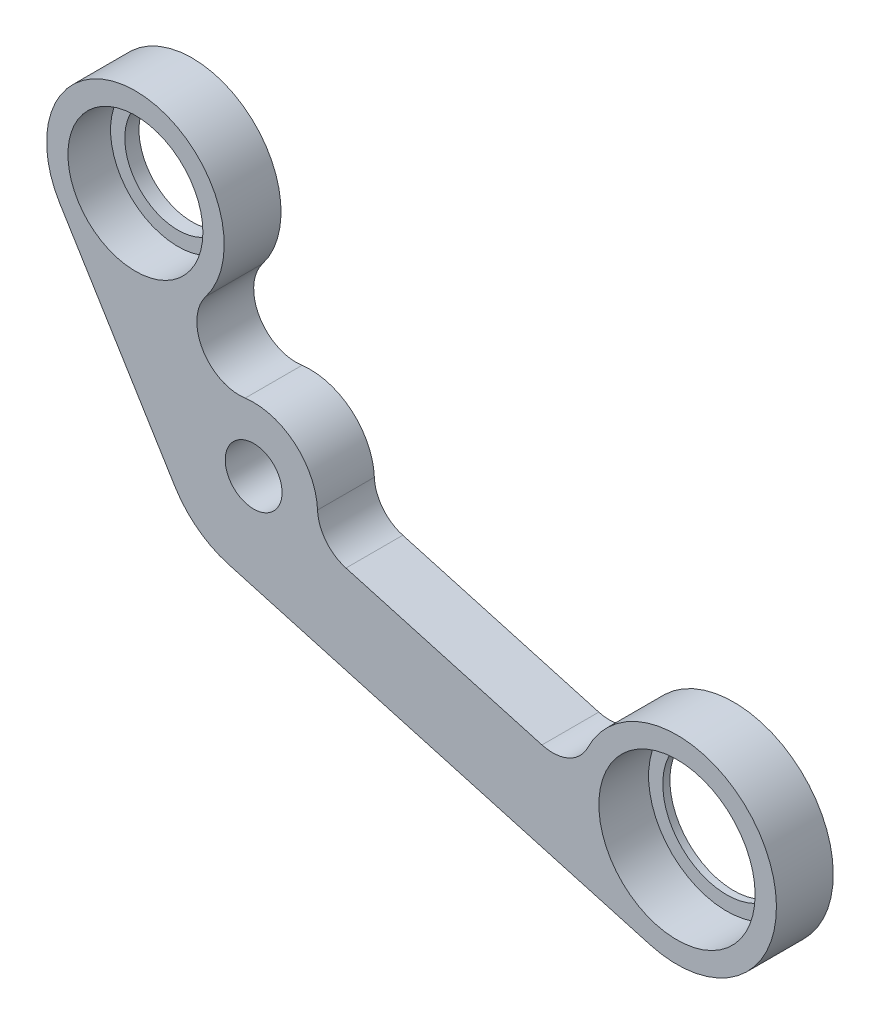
ISO-10303-21;
HEADER;
FILE_DESCRIPTION(('STEP AP214'),'2;1');
FILE_NAME('part.step','',(''),(''),'','','');
FILE_SCHEMA(('AUTOMOTIVE_DESIGN { 1 0 10303 214 1 1 1 1 }'));
ENDSEC;
DATA;
#1=APPLICATION_CONTEXT('core data for automotive mechanical design processes');
#2=APPLICATION_PROTOCOL_DEFINITION('international standard','automotive_design',2000,#1);
#3=PRODUCT_CONTEXT('',#1,'mechanical');
#4=PRODUCT('Part','Part','',(#3));
#5=PRODUCT_RELATED_PRODUCT_CATEGORY('part','',(#4));
#6=PRODUCT_DEFINITION_FORMATION('','',#4);
#7=PRODUCT_DEFINITION_CONTEXT('part definition',#1,'design');
#8=PRODUCT_DEFINITION('design','',#6,#7);
#9=PRODUCT_DEFINITION_SHAPE('','',#8);
#10=(LENGTH_UNIT() NAMED_UNIT(*) SI_UNIT(.MILLI.,.METRE.));
#11=(NAMED_UNIT(*) PLANE_ANGLE_UNIT() SI_UNIT($,.RADIAN.));
#12=(NAMED_UNIT(*) SI_UNIT($,.STERADIAN.) SOLID_ANGLE_UNIT());
#13=UNCERTAINTY_MEASURE_WITH_UNIT(LENGTH_MEASURE(1.E-05),#10,'distance_accuracy_value','');
#14=(GEOMETRIC_REPRESENTATION_CONTEXT(3) GLOBAL_UNCERTAINTY_ASSIGNED_CONTEXT((#13)) GLOBAL_UNIT_ASSIGNED_CONTEXT((#10,
#11,#12)) REPRESENTATION_CONTEXT('',''));
#15=CARTESIAN_POINT('',(0.,0.,0.));
#16=DIRECTION('',(0.,0.,1.));
#17=DIRECTION('',(1.,0.,0.));
#18=AXIS2_PLACEMENT_3D('',#15,#16,#17);
#19=CARTESIAN_POINT('',(-59.10260396,256.225433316,-25.));
#20=DIRECTION('',(0.,0.,1.));
#21=DIRECTION('',(1.,0.,0.));
#22=AXIS2_PLACEMENT_3D('',#19,#20,#21);
#23=CYLINDRICAL_SURFACE('',#22,7.50000000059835);
#24=CARTESIAN_POINT('',(-59.10260396,256.225433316,-25.));
#25=DIRECTION('',(0.,0.,1.));
#26=DIRECTION('',(1.,0.,0.));
#27=AXIS2_PLACEMENT_3D('',#24,#25,#26);
#28=CIRCLE('',#27,7.50000000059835);
#29=CARTESIAN_POINT('',(-51.6026039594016,256.225433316,-25.));
#30=VERTEX_POINT('',#29);
#31=EDGE_CURVE('E21',#30,#30,#28,.F.);
#32=CARTESIAN_POINT('',(-59.10260396,256.225433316,-23.));
#33=DIRECTION('',(0.,0.,1.));
#34=DIRECTION('',(1.,0.,0.));
#35=AXIS2_PLACEMENT_3D('',#32,#33,#34);
#36=CIRCLE('',#35,7.50000000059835);
#37=CARTESIAN_POINT('',(-51.6026039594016,256.225433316,-23.));
#38=VERTEX_POINT('',#37);
#39=EDGE_CURVE('E125',#38,#38,#36,.T.);
#40=CARTESIAN_POINT('',(-51.6026039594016,256.225433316,-25.));
#41=CARTESIAN_POINT('',(-51.6026039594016,256.225433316,-24.9791666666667));
#42=CARTESIAN_POINT('',(-51.6026039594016,256.225433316,-24.9583333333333));
#43=CARTESIAN_POINT('',(-51.6026039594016,256.225433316,-24.9166666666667));
#44=CARTESIAN_POINT('',(-51.6026039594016,256.225433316,-24.8958333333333));
#45=CARTESIAN_POINT('',(-51.6026039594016,256.225433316,-24.8541666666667));
#46=CARTESIAN_POINT('',(-51.6026039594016,256.225433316,-24.8333333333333));
#47=CARTESIAN_POINT('',(-51.6026039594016,256.225433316,-24.7916666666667));
#48=CARTESIAN_POINT('',(-51.6026039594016,256.225433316,-24.7708333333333));
#49=CARTESIAN_POINT('',(-51.6026039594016,256.225433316,-24.7291666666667));
#50=CARTESIAN_POINT('',(-51.6026039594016,256.225433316,-24.7083333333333));
#51=CARTESIAN_POINT('',(-51.6026039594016,256.225433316,-24.6666666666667));
#52=CARTESIAN_POINT('',(-51.6026039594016,256.225433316,-24.6458333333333));
#53=CARTESIAN_POINT('',(-51.6026039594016,256.225433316,-24.6041666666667));
#54=CARTESIAN_POINT('',(-51.6026039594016,256.225433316,-24.5833333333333));
#55=CARTESIAN_POINT('',(-51.6026039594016,256.225433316,-24.5416666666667));
#56=CARTESIAN_POINT('',(-51.6026039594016,256.225433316,-24.5208333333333));
#57=CARTESIAN_POINT('',(-51.6026039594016,256.225433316,-24.4791666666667));
#58=CARTESIAN_POINT('',(-51.6026039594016,256.225433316,-24.4583333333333));
#59=CARTESIAN_POINT('',(-51.6026039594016,256.225433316,-24.4166666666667));
#60=CARTESIAN_POINT('',(-51.6026039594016,256.225433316,-24.3958333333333));
#61=CARTESIAN_POINT('',(-51.6026039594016,256.225433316,-24.3541666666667));
#62=CARTESIAN_POINT('',(-51.6026039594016,256.225433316,-24.3333333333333));
#63=CARTESIAN_POINT('',(-51.6026039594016,256.225433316,-24.2916666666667));
#64=CARTESIAN_POINT('',(-51.6026039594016,256.225433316,-24.2708333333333));
#65=CARTESIAN_POINT('',(-51.6026039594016,256.225433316,-24.2291666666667));
#66=CARTESIAN_POINT('',(-51.6026039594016,256.225433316,-24.2083333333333));
#67=CARTESIAN_POINT('',(-51.6026039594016,256.225433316,-24.1666666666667));
#68=CARTESIAN_POINT('',(-51.6026039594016,256.225433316,-24.1458333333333));
#69=CARTESIAN_POINT('',(-51.6026039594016,256.225433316,-24.1041666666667));
#70=CARTESIAN_POINT('',(-51.6026039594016,256.225433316,-24.0833333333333));
#71=CARTESIAN_POINT('',(-51.6026039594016,256.225433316,-24.0416666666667));
#72=CARTESIAN_POINT('',(-51.6026039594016,256.225433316,-24.0208333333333));
#73=CARTESIAN_POINT('',(-51.6026039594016,256.225433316,-23.9791666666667));
#74=CARTESIAN_POINT('',(-51.6026039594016,256.225433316,-23.9583333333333));
#75=CARTESIAN_POINT('',(-51.6026039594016,256.225433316,-23.9166666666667));
#76=CARTESIAN_POINT('',(-51.6026039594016,256.225433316,-23.8958333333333));
#77=CARTESIAN_POINT('',(-51.6026039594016,256.225433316,-23.8541666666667));
#78=CARTESIAN_POINT('',(-51.6026039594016,256.225433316,-23.8333333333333));
#79=CARTESIAN_POINT('',(-51.6026039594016,256.225433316,-23.7916666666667));
#80=CARTESIAN_POINT('',(-51.6026039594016,256.225433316,-23.7708333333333));
#81=CARTESIAN_POINT('',(-51.6026039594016,256.225433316,-23.7291666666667));
#82=CARTESIAN_POINT('',(-51.6026039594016,256.225433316,-23.7083333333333));
#83=CARTESIAN_POINT('',(-51.6026039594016,256.225433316,-23.6666666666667));
#84=CARTESIAN_POINT('',(-51.6026039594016,256.225433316,-23.6458333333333));
#85=CARTESIAN_POINT('',(-51.6026039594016,256.225433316,-23.6041666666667));
#86=CARTESIAN_POINT('',(-51.6026039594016,256.225433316,-23.5833333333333));
#87=CARTESIAN_POINT('',(-51.6026039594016,256.225433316,-23.5416666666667));
#88=CARTESIAN_POINT('',(-51.6026039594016,256.225433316,-23.5208333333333));
#89=CARTESIAN_POINT('',(-51.6026039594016,256.225433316,-23.4791666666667));
#90=CARTESIAN_POINT('',(-51.6026039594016,256.225433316,-23.4583333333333));
#91=CARTESIAN_POINT('',(-51.6026039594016,256.225433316,-23.4166666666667));
#92=CARTESIAN_POINT('',(-51.6026039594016,256.225433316,-23.3958333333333));
#93=CARTESIAN_POINT('',(-51.6026039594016,256.225433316,-23.3541666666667));
#94=CARTESIAN_POINT('',(-51.6026039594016,256.225433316,-23.3333333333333));
#95=CARTESIAN_POINT('',(-51.6026039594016,256.225433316,-23.2916666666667));
#96=CARTESIAN_POINT('',(-51.6026039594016,256.225433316,-23.2708333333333));
#97=CARTESIAN_POINT('',(-51.6026039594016,256.225433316,-23.2291666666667));
#98=CARTESIAN_POINT('',(-51.6026039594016,256.225433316,-23.2083333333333));
#99=CARTESIAN_POINT('',(-51.6026039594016,256.225433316,-23.1666666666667));
#100=CARTESIAN_POINT('',(-51.6026039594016,256.225433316,-23.1458333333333));
#101=CARTESIAN_POINT('',(-51.6026039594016,256.225433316,-23.1041666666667));
#102=CARTESIAN_POINT('',(-51.6026039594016,256.225433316,-23.0833333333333));
#103=CARTESIAN_POINT('',(-51.6026039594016,256.225433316,-23.0416666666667));
#104=CARTESIAN_POINT('',(-51.6026039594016,256.225433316,-23.0208333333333));
#105=CARTESIAN_POINT('',(-51.6026039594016,256.225433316,-23.));
#106=B_SPLINE_CURVE_WITH_KNOTS('',3,(#40,#41,#42,#43,#44,#45,#46,#47,#48,#49,#50,#51,#52,#53,
#54,#55,#56,#57,#58,#59,#60,#61,#62,#63,#64,#65,#66,#67,#68,#69,#70,#71,#72,#73,#74,#75,#76,#77,
#78,#79,#80,#81,#82,#83,#84,#85,#86,#87,#88,#89,#90,#91,#92,#93,#94,#95,#96,#97,#98,#99,#100,
#101,#102,#103,#104,#105),.UNSPECIFIED.,.F.,.F.,(4,2,2,2,2,2,2,2,2,2,2,2,2,2,2,2,2,2,2,2,2,2,2,
2,2,2,2,2,2,2,2,2,4),(0.,0.0625000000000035,0.125000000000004,0.187500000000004,
0.250000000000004,0.312500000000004,0.375000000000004,0.437500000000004,0.500000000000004,
0.562500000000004,0.625000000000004,0.687500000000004,0.750000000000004,0.812500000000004,
0.875000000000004,0.937500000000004,1.,1.0625,1.125,1.1875,1.25,1.3125,1.375,1.4375,1.5,1.5625,
1.625,1.6875,1.75000000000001,1.81250000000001,1.87500000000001,1.93750000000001,
2.00000000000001),.UNSPECIFIED.);
#107=EDGE_CURVE('BSEAM17',#30,#38,#106,.T.);
#108=ORIENTED_EDGE('',*,*,#31,.T.);
#109=ORIENTED_EDGE('',*,*,#39,.T.);
#110=ORIENTED_EDGE('',*,*,#107,.T.);
#111=ORIENTED_EDGE('',*,*,#107,.F.);
#112=EDGE_LOOP('',(#108,#110,#109,#111));
#113=FACE_BOUND('',#112,.T.);
#114=ADVANCED_FACE('F17',(#113),#23,.F.);
#115=CARTESIAN_POINT('',(16.439924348,182.567015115,-25.));
#116=DIRECTION('',(0.,0.,1.));
#117=DIRECTION('',(0.481671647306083,0.876351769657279,0.));
#118=AXIS2_PLACEMENT_3D('',#115,#116,#117);
#119=PLANE('',#118);
#120=CARTESIAN_POINT('',(17.14,214.32,-25.));
#121=DIRECTION('',(0.,0.,1.));
#122=DIRECTION('',(1.,0.,0.));
#123=AXIS2_PLACEMENT_3D('',#120,#121,#122);
#124=CIRCLE('',#123,9.00000000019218);
#125=CARTESIAN_POINT('',(26.1400000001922,214.32,-25.));
#126=VERTEX_POINT('',#125);
#127=EDGE_CURVE('E104',#126,#126,#124,.F.);
#128=ORIENTED_EDGE('',*,*,#127,.F.);
#129=EDGE_LOOP('',(#128));
#130=FACE_BOUND('',#129,.T.);
#131=ORIENTED_EDGE('',*,*,#31,.F.);
#132=EDGE_LOOP('',(#131));
#133=FACE_BOUND('',#132,.T.);
#134=CARTESIAN_POINT('',(-42.457488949,230.060145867,-25.));
#135=DIRECTION('',(0.,0.,1.));
#136=DIRECTION('',(1.,0.,0.));
#137=AXIS2_PLACEMENT_3D('',#134,#135,#136);
#138=CIRCLE('',#137,4.00000000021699);
#139=CARTESIAN_POINT('',(-38.457488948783,230.060145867,-25.));
#140=VERTEX_POINT('',#139);
#141=EDGE_CURVE('E139',#140,#140,#138,.F.);
#142=ORIENTED_EDGE('',*,*,#141,.F.);
#143=EDGE_LOOP('',(#142));
#144=FACE_BOUND('',#143,.T.);
#145=DIRECTION('',(-0.962578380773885,0.271003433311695,0.));
#146=VECTOR('',#145,1.);
#147=CARTESIAN_POINT('',(-16.317290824,209.195264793,-25.));
#148=LINE('',#147,#146);
#149=CARTESIAN_POINT('',(13.3459519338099,200.843902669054,-25.));
#150=VERTEX_POINT('',#149);
#151=CARTESIAN_POINT('',(-45.9805335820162,217.546626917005,-25.));
#152=VERTEX_POINT('',#151);
#153=EDGE_CURVE('E147',#150,#152,#148,.T.);
#154=ORIENTED_EDGE('',*,*,#153,.T.);
#155=CARTESIAN_POINT('',(-42.457488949,230.060145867,-25.));
#156=DIRECTION('',(0.,0.,1.));
#157=DIRECTION('',(1.,0.,0.));
#158=AXIS2_PLACEMENT_3D('',#155,#156,#157);
#159=CIRCLE('',#158,13.0000000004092);
#160=CARTESIAN_POINT('',(-53.5372151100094,223.260170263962,-25.));
#161=VERTEX_POINT('',#160);
#162=EDGE_CURVE('E151',#152,#161,#159,.F.);
#163=ORIENTED_EDGE('',*,*,#162,.T.);
#164=DIRECTION('',(-0.52307504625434,0.852286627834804,0.));
#165=VECTOR('',#164,1.);
#166=CARTESIAN_POINT('',(-61.6467009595,236.473582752,-25.));
#167=LINE('',#166,#165);
#168=CARTESIAN_POINT('',(-69.7561868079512,249.686995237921,-25.));
#169=VERTEX_POINT('',#168);
#170=EDGE_CURVE('E158',#161,#169,#167,.T.);
#171=ORIENTED_EDGE('',*,*,#170,.T.);
#172=CARTESIAN_POINT('',(-59.10260396,256.225433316,-25.));
#173=DIRECTION('',(0.,0.,1.));
#174=DIRECTION('',(1.,0.,0.));
#175=AXIS2_PLACEMENT_3D('',#172,#173,#174);
#176=CIRCLE('',#175,12.5000000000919);
#177=CARTESIAN_POINT('',(-49.2047273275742,248.5911659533,-25.));
#178=VERTEX_POINT('',#177);
#179=EDGE_CURVE('E156',#169,#178,#176,.F.);
#180=ORIENTED_EDGE('',*,*,#179,.T.);
#181=CARTESIAN_POINT('',(-44.453746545,244.926717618,-25.));
#182=DIRECTION('',(0.,0.,1.));
#183=DIRECTION('',(1.,0.,0.));
#184=AXIS2_PLACEMENT_3D('',#181,#182,#183);
#185=CIRCLE('',#184,6.00000000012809);
#186=CARTESIAN_POINT('',(-43.655243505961,238.980088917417,-25.));
#187=VERTEX_POINT('',#186);
#188=EDGE_CURVE('E160',#187,#178,#185,.F.);
#189=ORIENTED_EDGE('',*,*,#188,.F.);
#190=CARTESIAN_POINT('',(-42.457488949,230.060145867,-25.));
#191=DIRECTION('',(0.,0.,1.));
#192=DIRECTION('',(1.,0.,0.));
#193=AXIS2_PLACEMENT_3D('',#190,#191,#192);
#194=CIRCLE('',#193,8.99999999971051);
#195=CARTESIAN_POINT('',(-33.4650968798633,230.430125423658,-25.));
#196=VERTEX_POINT('',#195);
#197=EDGE_CURVE('E163',#187,#196,#194,.F.);
#198=ORIENTED_EDGE('',*,*,#197,.T.);
#199=CARTESIAN_POINT('',(-27.969746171,230.656224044,-25.));
#200=DIRECTION('',(0.,0.,1.));
#201=DIRECTION('',(1.,0.,0.));
#202=AXIS2_PLACEMENT_3D('',#199,#200,#201);
#203=CIRCLE('',#202,5.49999999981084);
#204=CARTESIAN_POINT('',(-29.4602650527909,225.362042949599,-25.));
#205=VERTEX_POINT('',#204);
#206=EDGE_CURVE('E121',#205,#196,#203,.F.);
#207=ORIENTED_EDGE('',*,*,#206,.F.);
#208=DIRECTION('',(0.962578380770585,-0.271003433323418,0.));
#209=VECTOR('',#208,1.);
#210=CARTESIAN_POINT('',(-15.6638634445,221.477816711,-25.));
#211=LINE('',#210,#209);
#212=CARTESIAN_POINT('',(-1.86746183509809,217.593590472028,-25.));
#213=VERTEX_POINT('',#212);
#214=EDGE_CURVE('E116',#205,#213,#211,.T.);
#215=ORIENTED_EDGE('',*,*,#214,.T.);
#216=CARTESIAN_POINT('',(-0.376942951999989,222.887771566,-25.));
#217=DIRECTION('',(0.,0.,1.));
#218=DIRECTION('',(1.,0.,0.));
#219=AXIS2_PLACEMENT_3D('',#216,#217,#218);
#220=CIRCLE('',#219,5.49999999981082);
#221=CARTESIAN_POINT('',(4.5637332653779,220.471220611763,-25.));
#222=VERTEX_POINT('',#221);
#223=EDGE_CURVE('E109',#222,#213,#220,.F.);
#224=ORIENTED_EDGE('',*,*,#223,.F.);
#225=CARTESIAN_POINT('',(17.14,214.32,-25.));
#226=DIRECTION('',(0.,0.,1.));
#227=DIRECTION('',(1.,0.,0.));
#228=AXIS2_PLACEMENT_3D('',#225,#226,#227);
#229=CIRCLE('',#228,13.9999999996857);
#230=EDGE_CURVE('E93',#222,#150,#229,.F.);
#231=ORIENTED_EDGE('',*,*,#230,.T.);
#232=EDGE_LOOP('',(#154,#163,#171,#180,#189,#198,#207,#215,#224,#231));
#233=FACE_BOUND('',#232,.T.);
#234=ADVANCED_FACE('F114',(#130,#133,#144,#233),#119,.F.);
#235=CARTESIAN_POINT('',(-46.046566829,260.019888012,-23.));
#236=DIRECTION('',(0.,0.,-1.));
#237=DIRECTION('',(-0.481671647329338,-0.876351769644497,0.));
#238=AXIS2_PLACEMENT_3D('',#235,#236,#237);
#239=PLANE('',#238);
#240=ORIENTED_EDGE('',*,*,#39,.F.);
#241=EDGE_LOOP('',(#240));
#242=FACE_BOUND('',#241,.T.);
#243=CARTESIAN_POINT('',(-59.10260396,256.225433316,-23.));
#244=DIRECTION('',(0.,0.,1.));
#245=DIRECTION('',(1.,0.,0.));
#246=AXIS2_PLACEMENT_3D('',#243,#244,#245);
#247=CIRCLE('',#246,9.50000000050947);
#248=CARTESIAN_POINT('',(-49.6026039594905,256.225433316,-23.));
#249=VERTEX_POINT('',#248);
#250=EDGE_CURVE('E141',#249,#249,#247,.F.);
#251=ORIENTED_EDGE('',*,*,#250,.F.);
#252=EDGE_LOOP('',(#251));
#253=FACE_BOUND('',#252,.T.);
#254=ADVANCED_FACE('F134',(#242,#253),#239,.F.);
#255=CARTESIAN_POINT('',(17.14,214.32,-25.));
#256=DIRECTION('',(0.,0.,1.));
#257=DIRECTION('',(1.,0.,0.));
#258=AXIS2_PLACEMENT_3D('',#255,#256,#257);
#259=CYLINDRICAL_SURFACE('',#258,9.00000000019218);
#260=CARTESIAN_POINT('',(17.14,214.32,-24.));
#261=DIRECTION('',(0.,0.,1.));
#262=DIRECTION('',(1.,0.,0.));
#263=AXIS2_PLACEMENT_3D('',#260,#261,#262);
#264=CIRCLE('',#263,9.00000000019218);
#265=CARTESIAN_POINT('',(26.1400000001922,214.32,-24.));
#266=VERTEX_POINT('',#265);
#267=EDGE_CURVE('E145',#266,#266,#264,.F.);
#268=CARTESIAN_POINT('',(26.1400000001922,214.32,-24.));
#269=CARTESIAN_POINT('',(26.1400000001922,214.32,-24.0104166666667));
#270=CARTESIAN_POINT('',(26.1400000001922,214.32,-24.0208333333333));
#271=CARTESIAN_POINT('',(26.1400000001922,214.32,-24.0416666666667));
#272=CARTESIAN_POINT('',(26.1400000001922,214.32,-24.0520833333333));
#273=CARTESIAN_POINT('',(26.1400000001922,214.32,-24.0729166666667));
#274=CARTESIAN_POINT('',(26.1400000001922,214.32,-24.0833333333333));
#275=CARTESIAN_POINT('',(26.1400000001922,214.32,-24.1041666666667));
#276=CARTESIAN_POINT('',(26.1400000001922,214.32,-24.1145833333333));
#277=CARTESIAN_POINT('',(26.1400000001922,214.32,-24.1354166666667));
#278=CARTESIAN_POINT('',(26.1400000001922,214.32,-24.1458333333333));
#279=CARTESIAN_POINT('',(26.1400000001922,214.32,-24.1666666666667));
#280=CARTESIAN_POINT('',(26.1400000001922,214.32,-24.1770833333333));
#281=CARTESIAN_POINT('',(26.1400000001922,214.32,-24.1979166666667));
#282=CARTESIAN_POINT('',(26.1400000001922,214.32,-24.2083333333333));
#283=CARTESIAN_POINT('',(26.1400000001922,214.32,-24.2291666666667));
#284=CARTESIAN_POINT('',(26.1400000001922,214.32,-24.2395833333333));
#285=CARTESIAN_POINT('',(26.1400000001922,214.32,-24.2604166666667));
#286=CARTESIAN_POINT('',(26.1400000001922,214.32,-24.2708333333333));
#287=CARTESIAN_POINT('',(26.1400000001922,214.32,-24.2916666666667));
#288=CARTESIAN_POINT('',(26.1400000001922,214.32,-24.3020833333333));
#289=CARTESIAN_POINT('',(26.1400000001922,214.32,-24.3229166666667));
#290=CARTESIAN_POINT('',(26.1400000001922,214.32,-24.3333333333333));
#291=CARTESIAN_POINT('',(26.1400000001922,214.32,-24.3541666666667));
#292=CARTESIAN_POINT('',(26.1400000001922,214.32,-24.3645833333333));
#293=CARTESIAN_POINT('',(26.1400000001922,214.32,-24.3854166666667));
#294=CARTESIAN_POINT('',(26.1400000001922,214.32,-24.3958333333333));
#295=CARTESIAN_POINT('',(26.1400000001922,214.32,-24.4166666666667));
#296=CARTESIAN_POINT('',(26.1400000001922,214.32,-24.4270833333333));
#297=CARTESIAN_POINT('',(26.1400000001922,214.32,-24.4479166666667));
#298=CARTESIAN_POINT('',(26.1400000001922,214.32,-24.4583333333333));
#299=CARTESIAN_POINT('',(26.1400000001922,214.32,-24.4791666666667));
#300=CARTESIAN_POINT('',(26.1400000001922,214.32,-24.4895833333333));
#301=CARTESIAN_POINT('',(26.1400000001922,214.32,-24.5104166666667));
#302=CARTESIAN_POINT('',(26.1400000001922,214.32,-24.5208333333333));
#303=CARTESIAN_POINT('',(26.1400000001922,214.32,-24.5416666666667));
#304=CARTESIAN_POINT('',(26.1400000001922,214.32,-24.5520833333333));
#305=CARTESIAN_POINT('',(26.1400000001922,214.32,-24.5729166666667));
#306=CARTESIAN_POINT('',(26.1400000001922,214.32,-24.5833333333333));
#307=CARTESIAN_POINT('',(26.1400000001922,214.32,-24.6041666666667));
#308=CARTESIAN_POINT('',(26.1400000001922,214.32,-24.6145833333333));
#309=CARTESIAN_POINT('',(26.1400000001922,214.32,-24.6354166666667));
#310=CARTESIAN_POINT('',(26.1400000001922,214.32,-24.6458333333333));
#311=CARTESIAN_POINT('',(26.1400000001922,214.32,-24.6666666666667));
#312=CARTESIAN_POINT('',(26.1400000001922,214.32,-24.6770833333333));
#313=CARTESIAN_POINT('',(26.1400000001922,214.32,-24.6979166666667));
#314=CARTESIAN_POINT('',(26.1400000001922,214.32,-24.7083333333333));
#315=CARTESIAN_POINT('',(26.1400000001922,214.32,-24.7291666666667));
#316=CARTESIAN_POINT('',(26.1400000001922,214.32,-24.7395833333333));
#317=CARTESIAN_POINT('',(26.1400000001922,214.32,-24.7604166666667));
#318=CARTESIAN_POINT('',(26.1400000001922,214.32,-24.7708333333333));
#319=CARTESIAN_POINT('',(26.1400000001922,214.32,-24.7916666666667));
#320=CARTESIAN_POINT('',(26.1400000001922,214.32,-24.8020833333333));
#321=CARTESIAN_POINT('',(26.1400000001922,214.32,-24.8229166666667));
#322=CARTESIAN_POINT('',(26.1400000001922,214.32,-24.8333333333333));
#323=CARTESIAN_POINT('',(26.1400000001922,214.32,-24.8541666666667));
#324=CARTESIAN_POINT('',(26.1400000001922,214.32,-24.8645833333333));
#325=CARTESIAN_POINT('',(26.1400000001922,214.32,-24.8854166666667));
#326=CARTESIAN_POINT('',(26.1400000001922,214.32,-24.8958333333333));
#327=CARTESIAN_POINT('',(26.1400000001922,214.32,-24.9166666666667));
#328=CARTESIAN_POINT('',(26.1400000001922,214.32,-24.9270833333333));
#329=CARTESIAN_POINT('',(26.1400000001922,214.32,-24.9479166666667));
#330=CARTESIAN_POINT('',(26.1400000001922,214.32,-24.9583333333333));
#331=CARTESIAN_POINT('',(26.1400000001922,214.32,-24.9791666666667));
#332=CARTESIAN_POINT('',(26.1400000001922,214.32,-24.9895833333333));
#333=CARTESIAN_POINT('',(26.1400000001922,214.32,-25.));
#334=B_SPLINE_CURVE_WITH_KNOTS('',3,(#268,#269,#270,#271,#272,#273,#274,#275,#276,#277,#278,
#279,#280,#281,#282,#283,#284,#285,#286,#287,#288,#289,#290,#291,#292,#293,#294,#295,#296,#297,
#298,#299,#300,#301,#302,#303,#304,#305,#306,#307,#308,#309,#310,#311,#312,#313,#314,#315,#316,
#317,#318,#319,#320,#321,#322,#323,#324,#325,#326,#327,#328,#329,#330,#331,#332,#333),
.UNSPECIFIED.,.F.,.F.,(4,2,2,2,2,2,2,2,2,2,2,2,2,2,2,2,2,2,2,2,2,2,2,2,2,2,2,2,2,2,2,2,4),(0.,
0.03125,0.0625000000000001,0.0937500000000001,0.125,0.15625,0.1875,0.21875,0.25,0.28125,0.3125,
0.343750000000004,0.375,0.406250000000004,0.4375,0.468750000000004,0.5,0.53125,0.5625,
0.593750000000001,0.625000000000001,0.656250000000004,0.687500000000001,0.718750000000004,
0.750000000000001,0.781250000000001,0.812500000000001,0.843750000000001,0.875000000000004,
0.906250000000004,0.937500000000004,0.968750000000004,1.),.UNSPECIFIED.);
#335=EDGE_CURVE('BSEAM216',#266,#126,#334,.T.);
#336=ORIENTED_EDGE('',*,*,#267,.F.);
#337=ORIENTED_EDGE('',*,*,#127,.T.);
#338=ORIENTED_EDGE('',*,*,#335,.T.);
#339=ORIENTED_EDGE('',*,*,#335,.F.);
#340=EDGE_LOOP('',(#336,#338,#337,#339));
#341=FACE_BOUND('',#340,.T.);
#342=ADVANCED_FACE('F216',(#341),#259,.F.);
#343=CARTESIAN_POINT('',(17.14,214.32,-25.));
#344=DIRECTION('',(0.,0.,1.));
#345=DIRECTION('',(1.,0.,0.));
#346=AXIS2_PLACEMENT_3D('',#343,#344,#345);
#347=CYLINDRICAL_SURFACE('',#346,13.9999999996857);
#348=ORIENTED_EDGE('',*,*,#230,.F.);
#349=DIRECTION('',(0.,0.,1.));
#350=VECTOR('',#349,1.);
#351=CARTESIAN_POINT('',(4.56373326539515,220.471220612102,-21.));
#352=LINE('',#351,#350);
#353=CARTESIAN_POINT('',(4.5637332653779,220.471220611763,-17.));
#354=VERTEX_POINT('',#353);
#355=EDGE_CURVE('E96',#354,#222,#352,.F.);
#356=ORIENTED_EDGE('',*,*,#355,.F.);
#357=CARTESIAN_POINT('',(17.14,214.32,-17.));
#358=DIRECTION('',(0.,0.,1.));
#359=DIRECTION('',(1.,0.,0.));
#360=AXIS2_PLACEMENT_3D('',#357,#358,#359);
#361=CIRCLE('',#360,13.9999999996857);
#362=CARTESIAN_POINT('',(13.3459519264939,200.843902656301,-17.));
#363=VERTEX_POINT('',#362);
#364=EDGE_CURVE('E209',#363,#354,#361,.T.);
#365=ORIENTED_EDGE('',*,*,#364,.F.);
#366=DIRECTION('',(0.,0.,-1.));
#367=VECTOR('',#366,1.);
#368=CARTESIAN_POINT('',(13.345951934,200.843902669,-21.));
#369=LINE('',#368,#367);
#370=EDGE_CURVE('E99',#363,#150,#369,.T.);
#371=ORIENTED_EDGE('',*,*,#370,.T.);
#372=EDGE_LOOP('',(#348,#356,#365,#371));
#373=FACE_BOUND('',#372,.T.);
#374=ADVANCED_FACE('F95',(#373),#347,.T.);
#375=CARTESIAN_POINT('',(-0.376942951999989,222.887771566,-25.));
#376=DIRECTION('',(0.,0.,1.));
#377=DIRECTION('',(1.,0.,0.));
#378=AXIS2_PLACEMENT_3D('',#375,#376,#377);
#379=CYLINDRICAL_SURFACE('',#378,5.49999999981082);
#380=ORIENTED_EDGE('',*,*,#223,.T.);
#381=DIRECTION('',(0.,0.,1.));
#382=VECTOR('',#381,1.);
#383=CARTESIAN_POINT('',(-1.867461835,217.593590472,-21.));
#384=LINE('',#383,#382);
#385=CARTESIAN_POINT('',(-1.86746183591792,217.593590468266,-17.));
#386=VERTEX_POINT('',#385);
#387=EDGE_CURVE('E118',#213,#386,#384,.T.);
#388=ORIENTED_EDGE('',*,*,#387,.T.);
#389=CARTESIAN_POINT('',(-0.376942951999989,222.887771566,-17.));
#390=DIRECTION('',(0.,0.,1.));
#391=DIRECTION('',(1.,0.,0.));
#392=AXIS2_PLACEMENT_3D('',#389,#390,#391);
#393=CIRCLE('',#392,5.49999999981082);
#394=EDGE_CURVE('E111',#354,#386,#393,.F.);
#395=ORIENTED_EDGE('',*,*,#394,.F.);
#396=ORIENTED_EDGE('',*,*,#355,.T.);
#397=EDGE_LOOP('',(#380,#388,#395,#396));
#398=FACE_BOUND('',#397,.T.);
#399=ADVANCED_FACE('F107',(#398),#379,.F.);
#400=CARTESIAN_POINT('',(-1.867461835,217.593590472,-17.));
#401=DIRECTION('',(-0.271003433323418,-0.962578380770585,0.));
#402=DIRECTION('',(-0.962578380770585,0.271003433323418,0.));
#403=AXIS2_PLACEMENT_3D('',#400,#401,#402);
#404=PLANE('',#403);
#405=ORIENTED_EDGE('',*,*,#387,.F.);
#406=ORIENTED_EDGE('',*,*,#214,.F.);
#407=DIRECTION('',(0.,0.,1.));
#408=VECTOR('',#407,1.);
#409=CARTESIAN_POINT('',(-29.4602650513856,225.362042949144,-21.));
#410=LINE('',#409,#408);
#411=CARTESIAN_POINT('',(-29.460265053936,225.362042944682,-17.));
#412=VERTEX_POINT('',#411);
#413=EDGE_CURVE('E174',#412,#205,#410,.F.);
#414=ORIENTED_EDGE('',*,*,#413,.F.);
#415=DIRECTION('',(-0.96257838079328,0.271003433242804,0.));
#416=VECTOR('',#415,1.);
#417=CARTESIAN_POINT('',(-1.86746182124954,217.593590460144,-17.));
#418=LINE('',#417,#416);
#419=EDGE_CURVE('E206',#386,#412,#418,.T.);
#420=ORIENTED_EDGE('',*,*,#419,.F.);
#421=EDGE_LOOP('',(#405,#406,#414,#420));
#422=FACE_BOUND('',#421,.T.);
#423=ADVANCED_FACE('F233',(#422),#404,.F.);
#424=CARTESIAN_POINT('',(-27.969746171,230.656224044,-25.));
#425=DIRECTION('',(0.,0.,1.));
#426=DIRECTION('',(1.,0.,0.));
#427=AXIS2_PLACEMENT_3D('',#424,#425,#426);
#428=CYLINDRICAL_SURFACE('',#427,5.49999999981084);
#429=ORIENTED_EDGE('',*,*,#206,.T.);
#430=DIRECTION('',(0.,0.,-1.));
#431=VECTOR('',#430,1.);
#432=CARTESIAN_POINT('',(-33.4650968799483,230.430125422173,-21.));
#433=LINE('',#432,#431);
#434=CARTESIAN_POINT('',(-33.4650968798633,230.430125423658,-17.));
#435=VERTEX_POINT('',#434);
#436=EDGE_CURVE('E164',#196,#435,#433,.F.);
#437=ORIENTED_EDGE('',*,*,#436,.T.);
#438=CARTESIAN_POINT('',(-27.969746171,230.656224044,-17.));
#439=DIRECTION('',(0.,0.,1.));
#440=DIRECTION('',(1.,0.,0.));
#441=AXIS2_PLACEMENT_3D('',#438,#439,#440);
#442=CIRCLE('',#441,5.49999999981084);
#443=EDGE_CURVE('E203',#412,#435,#442,.F.);
#444=ORIENTED_EDGE('',*,*,#443,.F.);
#445=ORIENTED_EDGE('',*,*,#413,.T.);
#446=EDGE_LOOP('',(#429,#437,#444,#445));
#447=FACE_BOUND('',#446,.T.);
#448=ADVANCED_FACE('F235',(#447),#428,.F.);
#449=CARTESIAN_POINT('',(-42.457488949,230.060145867,-25.));
#450=DIRECTION('',(0.,0.,1.));
#451=DIRECTION('',(1.,0.,0.));
#452=AXIS2_PLACEMENT_3D('',#449,#450,#451);
#453=CYLINDRICAL_SURFACE('',#452,8.99999999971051);
#454=ORIENTED_EDGE('',*,*,#197,.F.);
#455=DIRECTION('',(0.,0.,1.));
#456=VECTOR('',#455,1.);
#457=CARTESIAN_POINT('',(-43.6552435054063,238.980088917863,-21.));
#458=LINE('',#457,#456);
#459=CARTESIAN_POINT('',(-43.655243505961,238.980088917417,-17.));
#460=VERTEX_POINT('',#459);
#461=EDGE_CURVE('E162',#460,#187,#458,.F.);
#462=ORIENTED_EDGE('',*,*,#461,.F.);
#463=CARTESIAN_POINT('',(-42.457488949,230.060145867,-17.));
#464=DIRECTION('',(0.,0.,1.));
#465=DIRECTION('',(1.,0.,0.));
#466=AXIS2_PLACEMENT_3D('',#463,#464,#465);
#467=CIRCLE('',#466,8.99999999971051);
#468=EDGE_CURVE('E201',#435,#460,#467,.T.);
#469=ORIENTED_EDGE('',*,*,#468,.F.);
#470=ORIENTED_EDGE('',*,*,#436,.F.);
#471=EDGE_LOOP('',(#454,#462,#469,#470));
#472=FACE_BOUND('',#471,.T.);
#473=ADVANCED_FACE('F262',(#472),#453,.T.);
#474=CARTESIAN_POINT('',(-44.453746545,244.926717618,-25.));
#475=DIRECTION('',(0.,0.,1.));
#476=DIRECTION('',(1.,0.,0.));
#477=AXIS2_PLACEMENT_3D('',#474,#475,#476);
#478=CYLINDRICAL_SURFACE('',#477,6.00000000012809);
#479=ORIENTED_EDGE('',*,*,#188,.T.);
#480=DIRECTION('',(0.,0.,-1.));
#481=VECTOR('',#480,1.);
#482=CARTESIAN_POINT('',(-49.2047273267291,248.591165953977,-21.));
#483=LINE('',#482,#481);
#484=CARTESIAN_POINT('',(-49.2047273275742,248.5911659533,-17.));
#485=VERTEX_POINT('',#484);
#486=EDGE_CURVE('E159',#178,#485,#483,.F.);
#487=ORIENTED_EDGE('',*,*,#486,.T.);
#488=CARTESIAN_POINT('',(-44.453746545,244.926717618,-17.));
#489=DIRECTION('',(0.,0.,1.));
#490=DIRECTION('',(1.,0.,0.));
#491=AXIS2_PLACEMENT_3D('',#488,#489,#490);
#492=CIRCLE('',#491,6.00000000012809);
#493=EDGE_CURVE('E198',#460,#485,#492,.F.);
#494=ORIENTED_EDGE('',*,*,#493,.F.);
#495=ORIENTED_EDGE('',*,*,#461,.T.);
#496=EDGE_LOOP('',(#479,#487,#494,#495));
#497=FACE_BOUND('',#496,.T.);
#498=ADVANCED_FACE('F259',(#497),#478,.F.);
#499=CARTESIAN_POINT('',(-59.10260396,256.225433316,-25.));
#500=DIRECTION('',(0.,0.,1.));
#501=DIRECTION('',(1.,0.,0.));
#502=AXIS2_PLACEMENT_3D('',#499,#500,#501);
#503=CYLINDRICAL_SURFACE('',#502,12.5000000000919);
#504=ORIENTED_EDGE('',*,*,#179,.F.);
#505=DIRECTION('',(0.,0.,1.));
#506=VECTOR('',#505,1.);
#507=CARTESIAN_POINT('',(-69.756186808,249.686995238,-21.));
#508=LINE('',#507,#506);
#509=CARTESIAN_POINT('',(-69.7561867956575,249.686995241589,-17.));
#510=VERTEX_POINT('',#509);
#511=EDGE_CURVE('E155',#169,#510,#508,.T.);
#512=ORIENTED_EDGE('',*,*,#511,.T.);
#513=CARTESIAN_POINT('',(-59.10260396,256.225433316,-17.));
#514=DIRECTION('',(0.,0.,1.));
#515=DIRECTION('',(1.,0.,0.));
#516=AXIS2_PLACEMENT_3D('',#513,#514,#515);
#517=CIRCLE('',#516,12.5000000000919);
#518=EDGE_CURVE('E196',#485,#510,#517,.T.);
#519=ORIENTED_EDGE('',*,*,#518,.F.);
#520=ORIENTED_EDGE('',*,*,#486,.F.);
#521=EDGE_LOOP('',(#504,#512,#519,#520));
#522=FACE_BOUND('',#521,.T.);
#523=ADVANCED_FACE('F240',(#522),#503,.T.);
#524=CARTESIAN_POINT('',(-69.756186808,249.686995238,-17.));
#525=DIRECTION('',(0.852286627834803,0.523075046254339,0.));
#526=DIRECTION('',(0.523075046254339,-0.852286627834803,0.));
#527=AXIS2_PLACEMENT_3D('',#524,#525,#526);
#528=PLANE('',#527);
#529=ORIENTED_EDGE('',*,*,#511,.F.);
#530=ORIENTED_EDGE('',*,*,#170,.F.);
#531=DIRECTION('',(0.,0.,-1.));
#532=VECTOR('',#531,1.);
#533=CARTESIAN_POINT('',(-53.5372151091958,223.260170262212,-21.));
#534=LINE('',#533,#532);
#535=CARTESIAN_POINT('',(-53.5372150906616,223.260170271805,-17.));
#536=VERTEX_POINT('',#535);
#537=EDGE_CURVE('E154',#161,#536,#534,.F.);
#538=ORIENTED_EDGE('',*,*,#537,.T.);
#539=DIRECTION('',(0.523075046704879,-0.852286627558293,0.));
#540=VECTOR('',#539,1.);
#541=CARTESIAN_POINT('',(-69.7561867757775,249.686995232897,-17.));
#542=LINE('',#541,#540);
#543=EDGE_CURVE('E194',#510,#536,#542,.T.);
#544=ORIENTED_EDGE('',*,*,#543,.F.);
#545=EDGE_LOOP('',(#529,#530,#538,#544));
#546=FACE_BOUND('',#545,.T.);
#547=ADVANCED_FACE('F237',(#546),#528,.F.);
#548=CARTESIAN_POINT('',(-42.457488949,230.060145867,-25.));
#549=DIRECTION('',(0.,0.,1.));
#550=DIRECTION('',(1.,0.,0.));
#551=AXIS2_PLACEMENT_3D('',#548,#549,#550);
#552=CYLINDRICAL_SURFACE('',#551,13.0000000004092);
#553=ORIENTED_EDGE('',*,*,#537,.F.);
#554=ORIENTED_EDGE('',*,*,#162,.F.);
#555=DIRECTION('',(0.,0.,1.));
#556=VECTOR('',#555,1.);
#557=CARTESIAN_POINT('',(-45.980533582,217.546626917,-21.));
#558=LINE('',#557,#556);
#559=CARTESIAN_POINT('',(-45.980533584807,217.54662691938,-17.));
#560=VERTEX_POINT('',#559);
#561=EDGE_CURVE('E142',#152,#560,#558,.T.);
#562=ORIENTED_EDGE('',*,*,#561,.T.);
#563=CARTESIAN_POINT('',(-42.457488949,230.060145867,-17.));
#564=DIRECTION('',(0.,0.,1.));
#565=DIRECTION('',(1.,0.,0.));
#566=AXIS2_PLACEMENT_3D('',#563,#564,#565);
#567=CIRCLE('',#566,13.0000000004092);
#568=EDGE_CURVE('E36',#536,#560,#567,.T.);
#569=ORIENTED_EDGE('',*,*,#568,.F.);
#570=EDGE_LOOP('',(#553,#554,#562,#569));
#571=FACE_BOUND('',#570,.T.);
#572=ADVANCED_FACE('F239',(#571),#552,.T.);
#573=CARTESIAN_POINT('',(-45.980533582,217.546626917,-17.));
#574=DIRECTION('',(0.271003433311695,0.962578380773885,0.));
#575=DIRECTION('',(0.962578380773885,-0.271003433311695,0.));
#576=AXIS2_PLACEMENT_3D('',#573,#574,#575);
#577=PLANE('',#576);
#578=ORIENTED_EDGE('',*,*,#561,.F.);
#579=ORIENTED_EDGE('',*,*,#153,.F.);
#580=ORIENTED_EDGE('',*,*,#370,.F.);
#581=DIRECTION('',(0.962578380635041,-0.271003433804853,0.));
#582=VECTOR('',#581,1.);
#583=CARTESIAN_POINT('',(-45.9805335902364,217.546626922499,-17.));
#584=LINE('',#583,#582);
#585=EDGE_CURVE('E191',#560,#363,#584,.T.);
#586=ORIENTED_EDGE('',*,*,#585,.F.);
#587=EDGE_LOOP('',(#578,#579,#580,#586));
#588=FACE_BOUND('',#587,.T.);
#589=ADVANCED_FACE('F242',(#588),#577,.F.);
#590=CARTESIAN_POINT('',(-42.457488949,230.060145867,-25.));
#591=DIRECTION('',(0.,0.,1.));
#592=DIRECTION('',(1.,0.,0.));
#593=AXIS2_PLACEMENT_3D('',#590,#591,#592);
#594=CYLINDRICAL_SURFACE('',#593,4.00000000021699);
#595=CARTESIAN_POINT('',(-42.457488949,230.060145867,-17.));
#596=DIRECTION('',(0.,0.,1.));
#597=DIRECTION('',(1.,0.,0.));
#598=AXIS2_PLACEMENT_3D('',#595,#596,#597);
#599=CIRCLE('',#598,4.00000000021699);
#600=CARTESIAN_POINT('',(-38.457488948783,230.060145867,-17.));
#601=VERTEX_POINT('',#600);
#602=EDGE_CURVE('E188',#601,#601,#599,.F.);
#603=CARTESIAN_POINT('',(-38.457488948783,230.060145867,-25.));
#604=CARTESIAN_POINT('',(-38.457488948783,230.060145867,-24.9166666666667));
#605=CARTESIAN_POINT('',(-38.457488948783,230.060145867,-24.8333333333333));
#606=CARTESIAN_POINT('',(-38.457488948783,230.060145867,-24.6666666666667));
#607=CARTESIAN_POINT('',(-38.457488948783,230.060145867,-24.5833333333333));
#608=CARTESIAN_POINT('',(-38.457488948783,230.060145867,-24.4166666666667));
#609=CARTESIAN_POINT('',(-38.457488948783,230.060145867,-24.3333333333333));
#610=CARTESIAN_POINT('',(-38.457488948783,230.060145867,-24.1666666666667));
#611=CARTESIAN_POINT('',(-38.457488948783,230.060145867,-24.0833333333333));
#612=CARTESIAN_POINT('',(-38.457488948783,230.060145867,-23.9166666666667));
#613=CARTESIAN_POINT('',(-38.457488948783,230.060145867,-23.8333333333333));
#614=CARTESIAN_POINT('',(-38.457488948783,230.060145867,-23.6666666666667));
#615=CARTESIAN_POINT('',(-38.457488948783,230.060145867,-23.5833333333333));
#616=CARTESIAN_POINT('',(-38.457488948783,230.060145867,-23.4166666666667));
#617=CARTESIAN_POINT('',(-38.457488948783,230.060145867,-23.3333333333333));
#618=CARTESIAN_POINT('',(-38.457488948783,230.060145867,-23.1666666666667));
#619=CARTESIAN_POINT('',(-38.457488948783,230.060145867,-23.0833333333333));
#620=CARTESIAN_POINT('',(-38.457488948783,230.060145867,-22.9166666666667));
#621=CARTESIAN_POINT('',(-38.457488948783,230.060145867,-22.8333333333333));
#622=CARTESIAN_POINT('',(-38.457488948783,230.060145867,-22.6666666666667));
#623=CARTESIAN_POINT('',(-38.457488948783,230.060145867,-22.5833333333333));
#624=CARTESIAN_POINT('',(-38.457488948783,230.060145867,-22.4166666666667));
#625=CARTESIAN_POINT('',(-38.457488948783,230.060145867,-22.3333333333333));
#626=CARTESIAN_POINT('',(-38.457488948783,230.060145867,-22.1666666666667));
#627=CARTESIAN_POINT('',(-38.457488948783,230.060145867,-22.0833333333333));
#628=CARTESIAN_POINT('',(-38.457488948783,230.060145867,-21.9166666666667));
#629=CARTESIAN_POINT('',(-38.457488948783,230.060145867,-21.8333333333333));
#630=CARTESIAN_POINT('',(-38.457488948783,230.060145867,-21.6666666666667));
#631=CARTESIAN_POINT('',(-38.457488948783,230.060145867,-21.5833333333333));
#632=CARTESIAN_POINT('',(-38.457488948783,230.060145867,-21.4166666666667));
#633=CARTESIAN_POINT('',(-38.457488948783,230.060145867,-21.3333333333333));
#634=CARTESIAN_POINT('',(-38.457488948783,230.060145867,-21.1666666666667));
#635=CARTESIAN_POINT('',(-38.457488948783,230.060145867,-21.0833333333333));
#636=CARTESIAN_POINT('',(-38.457488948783,230.060145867,-20.9166666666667));
#637=CARTESIAN_POINT('',(-38.457488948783,230.060145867,-20.8333333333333));
#638=CARTESIAN_POINT('',(-38.457488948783,230.060145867,-20.6666666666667));
#639=CARTESIAN_POINT('',(-38.457488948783,230.060145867,-20.5833333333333));
#640=CARTESIAN_POINT('',(-38.457488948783,230.060145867,-20.4166666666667));
#641=CARTESIAN_POINT('',(-38.457488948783,230.060145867,-20.3333333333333));
#642=CARTESIAN_POINT('',(-38.457488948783,230.060145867,-20.1666666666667));
#643=CARTESIAN_POINT('',(-38.457488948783,230.060145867,-20.0833333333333));
#644=CARTESIAN_POINT('',(-38.457488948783,230.060145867,-19.9166666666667));
#645=CARTESIAN_POINT('',(-38.457488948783,230.060145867,-19.8333333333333));
#646=CARTESIAN_POINT('',(-38.457488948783,230.060145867,-19.6666666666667));
#647=CARTESIAN_POINT('',(-38.457488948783,230.060145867,-19.5833333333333));
#648=CARTESIAN_POINT('',(-38.457488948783,230.060145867,-19.4166666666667));
#649=CARTESIAN_POINT('',(-38.457488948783,230.060145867,-19.3333333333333));
#650=CARTESIAN_POINT('',(-38.457488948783,230.060145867,-19.1666666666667));
#651=CARTESIAN_POINT('',(-38.457488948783,230.060145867,-19.0833333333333));
#652=CARTESIAN_POINT('',(-38.457488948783,230.060145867,-18.9166666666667));
#653=CARTESIAN_POINT('',(-38.457488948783,230.060145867,-18.8333333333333));
#654=CARTESIAN_POINT('',(-38.457488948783,230.060145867,-18.6666666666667));
#655=CARTESIAN_POINT('',(-38.457488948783,230.060145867,-18.5833333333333));
#656=CARTESIAN_POINT('',(-38.457488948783,230.060145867,-18.4166666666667));
#657=CARTESIAN_POINT('',(-38.457488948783,230.060145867,-18.3333333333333));
#658=CARTESIAN_POINT('',(-38.457488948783,230.060145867,-18.1666666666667));
#659=CARTESIAN_POINT('',(-38.457488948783,230.060145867,-18.0833333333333));
#660=CARTESIAN_POINT('',(-38.457488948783,230.060145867,-17.9166666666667));
#661=CARTESIAN_POINT('',(-38.457488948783,230.060145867,-17.8333333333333));
#662=CARTESIAN_POINT('',(-38.457488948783,230.060145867,-17.6666666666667));
#663=CARTESIAN_POINT('',(-38.457488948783,230.060145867,-17.5833333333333));
#664=CARTESIAN_POINT('',(-38.457488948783,230.060145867,-17.4166666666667));
#665=CARTESIAN_POINT('',(-38.457488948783,230.060145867,-17.3333333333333));
#666=CARTESIAN_POINT('',(-38.457488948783,230.060145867,-17.1666666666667));
#667=CARTESIAN_POINT('',(-38.457488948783,230.060145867,-17.0833333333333));
#668=CARTESIAN_POINT('',(-38.457488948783,230.060145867,-17.));
#669=B_SPLINE_CURVE_WITH_KNOTS('',3,(#603,#604,#605,#606,#607,#608,#609,#610,#611,#612,#613,
#614,#615,#616,#617,#618,#619,#620,#621,#622,#623,#624,#625,#626,#627,#628,#629,#630,#631,#632,
#633,#634,#635,#636,#637,#638,#639,#640,#641,#642,#643,#644,#645,#646,#647,#648,#649,#650,#651,
#652,#653,#654,#655,#656,#657,#658,#659,#660,#661,#662,#663,#664,#665,#666,#667,#668),
.UNSPECIFIED.,.F.,.F.,(4,2,2,2,2,2,2,2,2,2,2,2,2,2,2,2,2,2,2,2,2,2,2,2,2,2,2,2,2,2,2,2,4),(0.,
0.249999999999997,0.499999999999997,0.749999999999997,0.999999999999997,1.25,1.5,1.75,2.,2.25,
2.5,2.75,3.,3.25,3.5,3.75,4.,4.25,4.5,4.75,5.,5.25,5.5,5.75,6.,6.25,6.5,6.75,7.,7.25,7.5,7.75,
8.),.UNSPECIFIED.);
#670=EDGE_CURVE('BSEAM243',#140,#601,#669,.T.);
#671=ORIENTED_EDGE('',*,*,#141,.T.);
#672=ORIENTED_EDGE('',*,*,#602,.F.);
#673=ORIENTED_EDGE('',*,*,#670,.T.);
#674=ORIENTED_EDGE('',*,*,#670,.F.);
#675=EDGE_LOOP('',(#671,#673,#672,#674));
#676=FACE_BOUND('',#675,.T.);
#677=ADVANCED_FACE('F243',(#676),#594,.F.);
#678=CARTESIAN_POINT('',(-59.10260396,256.225433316,-23.));
#679=DIRECTION('',(0.,0.,1.));
#680=DIRECTION('',(1.,0.,0.));
#681=AXIS2_PLACEMENT_3D('',#678,#679,#680);
#682=CYLINDRICAL_SURFACE('',#681,9.50000000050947);
#683=CARTESIAN_POINT('',(-59.10260396,256.225433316,-17.));
#684=DIRECTION('',(0.,0.,1.));
#685=DIRECTION('',(1.,0.,0.));
#686=AXIS2_PLACEMENT_3D('',#683,#684,#685);
#687=CIRCLE('',#686,9.50000000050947);
#688=CARTESIAN_POINT('',(-49.6026039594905,256.225433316,-17.));
#689=VERTEX_POINT('',#688);
#690=EDGE_CURVE('E185',#689,#689,#687,.F.);
#691=CARTESIAN_POINT('',(-49.6026039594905,256.225433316,-23.));
#692=CARTESIAN_POINT('',(-49.6026039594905,256.225433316,-22.9375));
#693=CARTESIAN_POINT('',(-49.6026039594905,256.225433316,-22.875));
#694=CARTESIAN_POINT('',(-49.6026039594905,256.225433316,-22.75));
#695=CARTESIAN_POINT('',(-49.6026039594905,256.225433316,-22.6875));
#696=CARTESIAN_POINT('',(-49.6026039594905,256.225433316,-22.5625));
#697=CARTESIAN_POINT('',(-49.6026039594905,256.225433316,-22.5));
#698=CARTESIAN_POINT('',(-49.6026039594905,256.225433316,-22.375));
#699=CARTESIAN_POINT('',(-49.6026039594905,256.225433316,-22.3125));
#700=CARTESIAN_POINT('',(-49.6026039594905,256.225433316,-22.1875));
#701=CARTESIAN_POINT('',(-49.6026039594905,256.225433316,-22.125));
#702=CARTESIAN_POINT('',(-49.6026039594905,256.225433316,-22.));
#703=CARTESIAN_POINT('',(-49.6026039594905,256.225433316,-21.9375));
#704=CARTESIAN_POINT('',(-49.6026039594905,256.225433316,-21.8125));
#705=CARTESIAN_POINT('',(-49.6026039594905,256.225433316,-21.75));
#706=CARTESIAN_POINT('',(-49.6026039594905,256.225433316,-21.625));
#707=CARTESIAN_POINT('',(-49.6026039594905,256.225433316,-21.5625));
#708=CARTESIAN_POINT('',(-49.6026039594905,256.225433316,-21.4375));
#709=CARTESIAN_POINT('',(-49.6026039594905,256.225433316,-21.375));
#710=CARTESIAN_POINT('',(-49.6026039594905,256.225433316,-21.25));
#711=CARTESIAN_POINT('',(-49.6026039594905,256.225433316,-21.1875));
#712=CARTESIAN_POINT('',(-49.6026039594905,256.225433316,-21.0625));
#713=CARTESIAN_POINT('',(-49.6026039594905,256.225433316,-21.));
#714=CARTESIAN_POINT('',(-49.6026039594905,256.225433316,-20.875));
#715=CARTESIAN_POINT('',(-49.6026039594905,256.225433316,-20.8125));
#716=CARTESIAN_POINT('',(-49.6026039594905,256.225433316,-20.6875));
#717=CARTESIAN_POINT('',(-49.6026039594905,256.225433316,-20.625));
#718=CARTESIAN_POINT('',(-49.6026039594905,256.225433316,-20.5));
#719=CARTESIAN_POINT('',(-49.6026039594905,256.225433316,-20.4375));
#720=CARTESIAN_POINT('',(-49.6026039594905,256.225433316,-20.3125));
#721=CARTESIAN_POINT('',(-49.6026039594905,256.225433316,-20.25));
#722=CARTESIAN_POINT('',(-49.6026039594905,256.225433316,-20.125));
#723=CARTESIAN_POINT('',(-49.6026039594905,256.225433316,-20.0625));
#724=CARTESIAN_POINT('',(-49.6026039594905,256.225433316,-19.9375));
#725=CARTESIAN_POINT('',(-49.6026039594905,256.225433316,-19.875));
#726=CARTESIAN_POINT('',(-49.6026039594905,256.225433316,-19.75));
#727=CARTESIAN_POINT('',(-49.6026039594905,256.225433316,-19.6875));
#728=CARTESIAN_POINT('',(-49.6026039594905,256.225433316,-19.5625));
#729=CARTESIAN_POINT('',(-49.6026039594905,256.225433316,-19.5));
#730=CARTESIAN_POINT('',(-49.6026039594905,256.225433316,-19.375));
#731=CARTESIAN_POINT('',(-49.6026039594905,256.225433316,-19.3125));
#732=CARTESIAN_POINT('',(-49.6026039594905,256.225433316,-19.1875));
#733=CARTESIAN_POINT('',(-49.6026039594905,256.225433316,-19.125));
#734=CARTESIAN_POINT('',(-49.6026039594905,256.225433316,-19.));
#735=CARTESIAN_POINT('',(-49.6026039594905,256.225433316,-18.9375));
#736=CARTESIAN_POINT('',(-49.6026039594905,256.225433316,-18.8125));
#737=CARTESIAN_POINT('',(-49.6026039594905,256.225433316,-18.75));
#738=CARTESIAN_POINT('',(-49.6026039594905,256.225433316,-18.625));
#739=CARTESIAN_POINT('',(-49.6026039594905,256.225433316,-18.5625));
#740=CARTESIAN_POINT('',(-49.6026039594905,256.225433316,-18.4375));
#741=CARTESIAN_POINT('',(-49.6026039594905,256.225433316,-18.375));
#742=CARTESIAN_POINT('',(-49.6026039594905,256.225433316,-18.25));
#743=CARTESIAN_POINT('',(-49.6026039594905,256.225433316,-18.1875));
#744=CARTESIAN_POINT('',(-49.6026039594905,256.225433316,-18.0625));
#745=CARTESIAN_POINT('',(-49.6026039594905,256.225433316,-18.));
#746=CARTESIAN_POINT('',(-49.6026039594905,256.225433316,-17.875));
#747=CARTESIAN_POINT('',(-49.6026039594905,256.225433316,-17.8125));
#748=CARTESIAN_POINT('',(-49.6026039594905,256.225433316,-17.6875));
#749=CARTESIAN_POINT('',(-49.6026039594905,256.225433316,-17.625));
#750=CARTESIAN_POINT('',(-49.6026039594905,256.225433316,-17.5));
#751=CARTESIAN_POINT('',(-49.6026039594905,256.225433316,-17.4375));
#752=CARTESIAN_POINT('',(-49.6026039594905,256.225433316,-17.3125));
#753=CARTESIAN_POINT('',(-49.6026039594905,256.225433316,-17.25));
#754=CARTESIAN_POINT('',(-49.6026039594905,256.225433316,-17.125));
#755=CARTESIAN_POINT('',(-49.6026039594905,256.225433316,-17.0625));
#756=CARTESIAN_POINT('',(-49.6026039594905,256.225433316,-17.));
#757=B_SPLINE_CURVE_WITH_KNOTS('',3,(#691,#692,#693,#694,#695,#696,#697,#698,#699,#700,#701,
#702,#703,#704,#705,#706,#707,#708,#709,#710,#711,#712,#713,#714,#715,#716,#717,#718,#719,#720,
#721,#722,#723,#724,#725,#726,#727,#728,#729,#730,#731,#732,#733,#734,#735,#736,#737,#738,#739,
#740,#741,#742,#743,#744,#745,#746,#747,#748,#749,#750,#751,#752,#753,#754,#755,#756),
.UNSPECIFIED.,.F.,.F.,(4,2,2,2,2,2,2,2,2,2,2,2,2,2,2,2,2,2,2,2,2,2,2,2,2,2,2,2,2,2,2,2,4),(0.,
0.1875,0.375,0.5625,0.750000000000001,0.937500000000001,1.125,1.3125,1.5,1.6875,1.875,2.0625,
2.25,2.4375,2.625,2.8125,3.,3.1875,3.375,3.5625,3.75,3.9375,4.125,4.3125,4.5,4.6875,4.875,
5.0625,5.25,5.4375,5.625,5.8125,6.),.UNSPECIFIED.);
#758=EDGE_CURVE('BSEAM230',#249,#689,#757,.T.);
#759=ORIENTED_EDGE('',*,*,#250,.T.);
#760=ORIENTED_EDGE('',*,*,#690,.F.);
#761=ORIENTED_EDGE('',*,*,#758,.T.);
#762=ORIENTED_EDGE('',*,*,#758,.F.);
#763=EDGE_LOOP('',(#759,#761,#760,#762));
#764=FACE_BOUND('',#763,.T.);
#765=ADVANCED_FACE('F230',(#764),#682,.F.);
#766=CARTESIAN_POINT('',(21.533579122,199.202483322,-24.));
#767=DIRECTION('',(0.,0.,1.));
#768=DIRECTION('',(0.481671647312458,0.876351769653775,0.));
#769=AXIS2_PLACEMENT_3D('',#766,#767,#768);
#770=PLANE('',#769);
#771=ORIENTED_EDGE('',*,*,#267,.T.);
#772=EDGE_LOOP('',(#771));
#773=FACE_BOUND('',#772,.T.);
#774=CARTESIAN_POINT('',(17.14,214.32,-24.));
#775=DIRECTION('',(0.,0.,1.));
#776=DIRECTION('',(1.,0.,0.));
#777=AXIS2_PLACEMENT_3D('',#774,#775,#776);
#778=CIRCLE('',#777,10.9999999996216);
#779=CARTESIAN_POINT('',(28.1399999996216,214.32,-24.));
#780=VERTEX_POINT('',#779);
#781=EDGE_CURVE('E27',#780,#780,#778,.F.);
#782=ORIENTED_EDGE('',*,*,#781,.F.);
#783=EDGE_LOOP('',(#782));
#784=FACE_BOUND('',#783,.T.);
#785=ADVANCED_FACE('F213',(#773,#784),#770,.T.);
#786=CARTESIAN_POINT('',(16.439924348,182.567015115,-17.));
#787=DIRECTION('',(0.,0.,1.));
#788=DIRECTION('',(0.481671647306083,0.876351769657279,0.));
#789=AXIS2_PLACEMENT_3D('',#786,#787,#788);
#790=PLANE('',#789);
#791=ORIENTED_EDGE('',*,*,#690,.T.);
#792=EDGE_LOOP('',(#791));
#793=FACE_BOUND('',#792,.T.);
#794=ORIENTED_EDGE('',*,*,#602,.T.);
#795=EDGE_LOOP('',(#794));
#796=FACE_BOUND('',#795,.T.);
#797=CARTESIAN_POINT('',(17.14,214.32,-17.));
#798=DIRECTION('',(0.,0.,1.));
#799=DIRECTION('',(1.,0.,0.));
#800=AXIS2_PLACEMENT_3D('',#797,#798,#799);
#801=CIRCLE('',#800,10.9999999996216);
#802=CARTESIAN_POINT('',(28.1399999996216,214.32,-17.));
#803=VERTEX_POINT('',#802);
#804=EDGE_CURVE('E10',#803,#803,#801,.T.);
#805=ORIENTED_EDGE('',*,*,#804,.F.);
#806=EDGE_LOOP('',(#805));
#807=FACE_BOUND('',#806,.T.);
#808=ORIENTED_EDGE('',*,*,#568,.T.);
#809=ORIENTED_EDGE('',*,*,#585,.T.);
#810=ORIENTED_EDGE('',*,*,#364,.T.);
#811=ORIENTED_EDGE('',*,*,#394,.T.);
#812=ORIENTED_EDGE('',*,*,#419,.T.);
#813=ORIENTED_EDGE('',*,*,#443,.T.);
#814=ORIENTED_EDGE('',*,*,#468,.T.);
#815=ORIENTED_EDGE('',*,*,#493,.T.);
#816=ORIENTED_EDGE('',*,*,#518,.T.);
#817=ORIENTED_EDGE('',*,*,#543,.T.);
#818=EDGE_LOOP('',(#808,#809,#810,#811,#812,#813,#814,#815,#816,#817));
#819=FACE_BOUND('',#818,.T.);
#820=ADVANCED_FACE('F19',(#793,#796,#807,#819),#790,.T.);
#821=CARTESIAN_POINT('',(17.14,214.32,-24.));
#822=DIRECTION('',(0.,0.,1.));
#823=DIRECTION('',(1.,0.,0.));
#824=AXIS2_PLACEMENT_3D('',#821,#822,#823);
#825=CYLINDRICAL_SURFACE('',#824,10.9999999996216);
#826=CARTESIAN_POINT('',(28.1399999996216,214.32,-17.));
#827=CARTESIAN_POINT('',(28.1399999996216,214.32,-17.0729166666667));
#828=CARTESIAN_POINT('',(28.1399999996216,214.32,-17.1458333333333));
#829=CARTESIAN_POINT('',(28.1399999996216,214.32,-17.2916666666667));
#830=CARTESIAN_POINT('',(28.1399999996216,214.32,-17.3645833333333));
#831=CARTESIAN_POINT('',(28.1399999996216,214.32,-17.5104166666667));
#832=CARTESIAN_POINT('',(28.1399999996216,214.32,-17.5833333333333));
#833=CARTESIAN_POINT('',(28.1399999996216,214.32,-17.7291666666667));
#834=CARTESIAN_POINT('',(28.1399999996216,214.32,-17.8020833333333));
#835=CARTESIAN_POINT('',(28.1399999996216,214.32,-17.9479166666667));
#836=CARTESIAN_POINT('',(28.1399999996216,214.32,-18.0208333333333));
#837=CARTESIAN_POINT('',(28.1399999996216,214.32,-18.1666666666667));
#838=CARTESIAN_POINT('',(28.1399999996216,214.32,-18.2395833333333));
#839=CARTESIAN_POINT('',(28.1399999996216,214.32,-18.3854166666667));
#840=CARTESIAN_POINT('',(28.1399999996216,214.32,-18.4583333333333));
#841=CARTESIAN_POINT('',(28.1399999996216,214.32,-18.6041666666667));
#842=CARTESIAN_POINT('',(28.1399999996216,214.32,-18.6770833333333));
#843=CARTESIAN_POINT('',(28.1399999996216,214.32,-18.8229166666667));
#844=CARTESIAN_POINT('',(28.1399999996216,214.32,-18.8958333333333));
#845=CARTESIAN_POINT('',(28.1399999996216,214.32,-19.0416666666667));
#846=CARTESIAN_POINT('',(28.1399999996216,214.32,-19.1145833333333));
#847=CARTESIAN_POINT('',(28.1399999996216,214.32,-19.2604166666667));
#848=CARTESIAN_POINT('',(28.1399999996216,214.32,-19.3333333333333));
#849=CARTESIAN_POINT('',(28.1399999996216,214.32,-19.4791666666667));
#850=CARTESIAN_POINT('',(28.1399999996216,214.32,-19.5520833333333));
#851=CARTESIAN_POINT('',(28.1399999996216,214.32,-19.6979166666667));
#852=CARTESIAN_POINT('',(28.1399999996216,214.32,-19.7708333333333));
#853=CARTESIAN_POINT('',(28.1399999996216,214.32,-19.9166666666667));
#854=CARTESIAN_POINT('',(28.1399999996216,214.32,-19.9895833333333));
#855=CARTESIAN_POINT('',(28.1399999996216,214.32,-20.1354166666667));
#856=CARTESIAN_POINT('',(28.1399999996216,214.32,-20.2083333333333));
#857=CARTESIAN_POINT('',(28.1399999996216,214.32,-20.3541666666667));
#858=CARTESIAN_POINT('',(28.1399999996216,214.32,-20.4270833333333));
#859=CARTESIAN_POINT('',(28.1399999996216,214.32,-20.5729166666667));
#860=CARTESIAN_POINT('',(28.1399999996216,214.32,-20.6458333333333));
#861=CARTESIAN_POINT('',(28.1399999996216,214.32,-20.7916666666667));
#862=CARTESIAN_POINT('',(28.1399999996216,214.32,-20.8645833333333));
#863=CARTESIAN_POINT('',(28.1399999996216,214.32,-21.0104166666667));
#864=CARTESIAN_POINT('',(28.1399999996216,214.32,-21.0833333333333));
#865=CARTESIAN_POINT('',(28.1399999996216,214.32,-21.2291666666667));
#866=CARTESIAN_POINT('',(28.1399999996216,214.32,-21.3020833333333));
#867=CARTESIAN_POINT('',(28.1399999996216,214.32,-21.4479166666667));
#868=CARTESIAN_POINT('',(28.1399999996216,214.32,-21.5208333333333));
#869=CARTESIAN_POINT('',(28.1399999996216,214.32,-21.6666666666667));
#870=CARTESIAN_POINT('',(28.1399999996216,214.32,-21.7395833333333));
#871=CARTESIAN_POINT('',(28.1399999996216,214.32,-21.8854166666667));
#872=CARTESIAN_POINT('',(28.1399999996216,214.32,-21.9583333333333));
#873=CARTESIAN_POINT('',(28.1399999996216,214.32,-22.1041666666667));
#874=CARTESIAN_POINT('',(28.1399999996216,214.32,-22.1770833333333));
#875=CARTESIAN_POINT('',(28.1399999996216,214.32,-22.3229166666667));
#876=CARTESIAN_POINT('',(28.1399999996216,214.32,-22.3958333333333));
#877=CARTESIAN_POINT('',(28.1399999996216,214.32,-22.5416666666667));
#878=CARTESIAN_POINT('',(28.1399999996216,214.32,-22.6145833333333));
#879=CARTESIAN_POINT('',(28.1399999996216,214.32,-22.7604166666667));
#880=CARTESIAN_POINT('',(28.1399999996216,214.32,-22.8333333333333));
#881=CARTESIAN_POINT('',(28.1399999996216,214.32,-22.9791666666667));
#882=CARTESIAN_POINT('',(28.1399999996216,214.32,-23.0520833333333));
#883=CARTESIAN_POINT('',(28.1399999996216,214.32,-23.1979166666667));
#884=CARTESIAN_POINT('',(28.1399999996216,214.32,-23.2708333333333));
#885=CARTESIAN_POINT('',(28.1399999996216,214.32,-23.4166666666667));
#886=CARTESIAN_POINT('',(28.1399999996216,214.32,-23.4895833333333));
#887=CARTESIAN_POINT('',(28.1399999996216,214.32,-23.6354166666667));
#888=CARTESIAN_POINT('',(28.1399999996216,214.32,-23.7083333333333));
#889=CARTESIAN_POINT('',(28.1399999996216,214.32,-23.8541666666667));
#890=CARTESIAN_POINT('',(28.1399999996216,214.32,-23.9270833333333));
#891=CARTESIAN_POINT('',(28.1399999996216,214.32,-24.));
#892=B_SPLINE_CURVE_WITH_KNOTS('',3,(#826,#827,#828,#829,#830,#831,#832,#833,#834,#835,#836,
#837,#838,#839,#840,#841,#842,#843,#844,#845,#846,#847,#848,#849,#850,#851,#852,#853,#854,#855,
#856,#857,#858,#859,#860,#861,#862,#863,#864,#865,#866,#867,#868,#869,#870,#871,#872,#873,#874,
#875,#876,#877,#878,#879,#880,#881,#882,#883,#884,#885,#886,#887,#888,#889,#890,#891),
.UNSPECIFIED.,.F.,.F.,(4,2,2,2,2,2,2,2,2,2,2,2,2,2,2,2,2,2,2,2,2,2,2,2,2,2,2,2,2,2,2,2,4),(0.,
0.21875,0.4375,0.656250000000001,0.874999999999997,1.09375,1.3125,1.53125,1.75,1.96875,2.1875,
2.40625,2.625,2.84375,3.0625,3.28125,3.5,3.71875,3.9375,4.15625,4.375,4.59375,4.8125,5.03125,
5.25,5.46875,5.6875,5.90625,6.125,6.34375,6.5625,6.78125,7.),.UNSPECIFIED.);
#893=EDGE_CURVE('BSEAM224',#803,#780,#892,.T.);
#894=ORIENTED_EDGE('',*,*,#804,.T.);
#895=ORIENTED_EDGE('',*,*,#781,.T.);
#896=ORIENTED_EDGE('',*,*,#893,.T.);
#897=ORIENTED_EDGE('',*,*,#893,.F.);
#898=EDGE_LOOP('',(#894,#896,#895,#897));
#899=FACE_BOUND('',#898,.T.);
#900=ADVANCED_FACE('F224',(#899),#825,.F.);
#901=CLOSED_SHELL('',(#114,#234,#254,#342,#374,#399,#423,#448,#473,#498,#523,#547,#572,#589,
#677,#765,#785,#820,#900));
#902=MANIFOLD_SOLID_BREP('B1',#901);
#903=ADVANCED_BREP_SHAPE_REPRESENTATION('',(#18,#902),#14);
#904=SHAPE_DEFINITION_REPRESENTATION(#9,#903);
ENDSEC;
END-ISO-10303-21;
